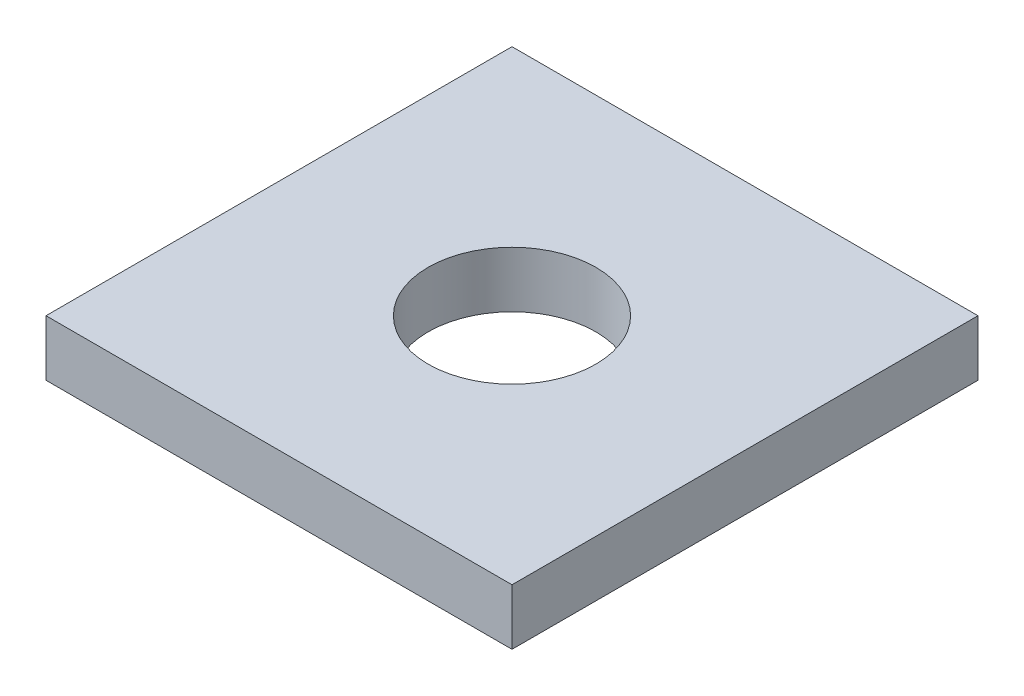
from build123d import *

# Parameters (mm, degrees)
SKETCH1_W      = 25
SKETCH1_H      = 25
SKETCH1_R      = 4.5
EXTRUDE1_DEPTH = 3


with BuildPart() as part:
    # Sketch1 → Extrude1 (new body)
    with BuildSketch(Plane(origin=(0, 0, 0), x_dir=(1, 0, 0), z_dir=(0, 1, 0))):
        with Locations((12.5, 12.5)):
            Rectangle(SKETCH1_W, SKETCH1_H)
        with Locations(Location((12.5, 12.5, 0), (0, 0, 270))):
            Circle(SKETCH1_R, mode=Mode.SUBTRACT)
    extrude(amount=EXTRUDE1_DEPTH)


solid = part.part
